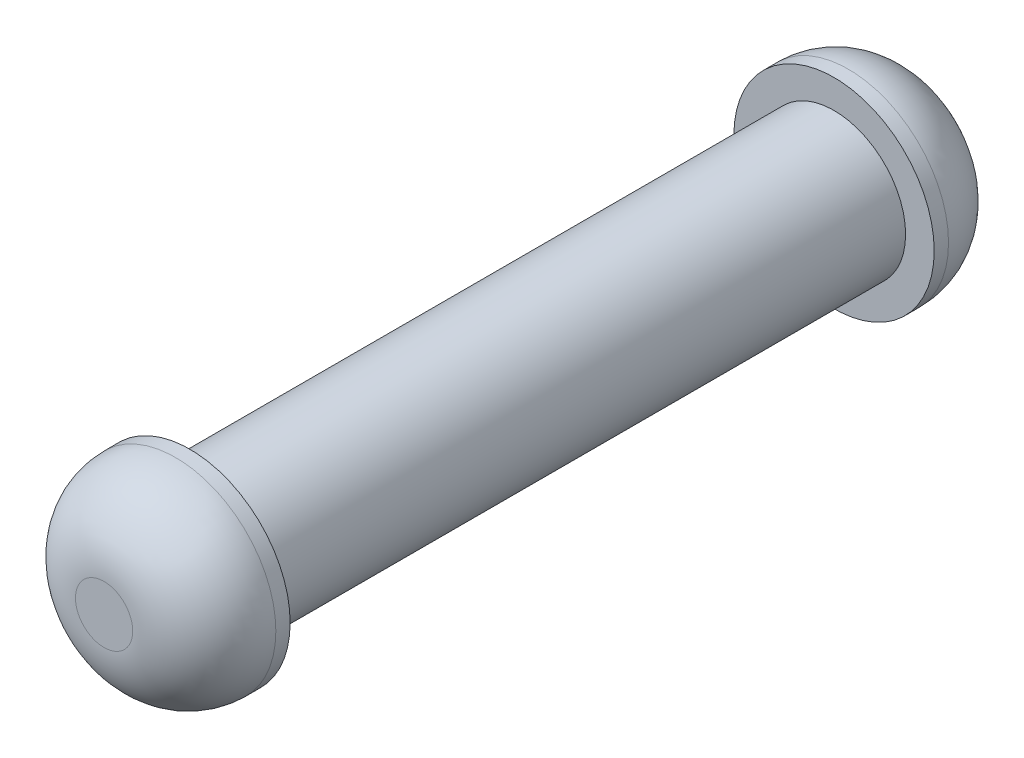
ISO-10303-21;
HEADER;
FILE_DESCRIPTION(('STEP AP214'),'2;1');
FILE_NAME('part.step','',(''),(''),'','','');
FILE_SCHEMA(('AUTOMOTIVE_DESIGN { 1 0 10303 214 1 1 1 1 }'));
ENDSEC;
DATA;
#1=APPLICATION_CONTEXT('core data for automotive mechanical design processes');
#2=APPLICATION_PROTOCOL_DEFINITION('international standard','automotive_design',2000,#1);
#3=PRODUCT_CONTEXT('',#1,'mechanical');
#4=PRODUCT('Part','Part','',(#3));
#5=PRODUCT_RELATED_PRODUCT_CATEGORY('part','',(#4));
#6=PRODUCT_DEFINITION_FORMATION('','',#4);
#7=PRODUCT_DEFINITION_CONTEXT('part definition',#1,'design');
#8=PRODUCT_DEFINITION('design','',#6,#7);
#9=PRODUCT_DEFINITION_SHAPE('','',#8);
#10=(LENGTH_UNIT() NAMED_UNIT(*) SI_UNIT(.MILLI.,.METRE.));
#11=(NAMED_UNIT(*) PLANE_ANGLE_UNIT() SI_UNIT($,.RADIAN.));
#12=(NAMED_UNIT(*) SI_UNIT($,.STERADIAN.) SOLID_ANGLE_UNIT());
#13=UNCERTAINTY_MEASURE_WITH_UNIT(LENGTH_MEASURE(1.E-05),#10,'distance_accuracy_value','');
#14=(GEOMETRIC_REPRESENTATION_CONTEXT(3) GLOBAL_UNCERTAINTY_ASSIGNED_CONTEXT((#13)) GLOBAL_UNIT_ASSIGNED_CONTEXT((#10,
#11,#12)) REPRESENTATION_CONTEXT('',''));
#15=CARTESIAN_POINT('',(0.,0.,0.));
#16=DIRECTION('',(0.,0.,1.));
#17=DIRECTION('',(1.,0.,0.));
#18=AXIS2_PLACEMENT_3D('',#15,#16,#17);
#19=CARTESIAN_POINT('',(-85.,45.0000000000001,136.5));
#20=DIRECTION('',(0.,0.,1.));
#21=DIRECTION('',(1.,0.,0.));
#22=AXIS2_PLACEMENT_3D('',#19,#20,#21);
#23=CYLINDRICAL_SURFACE('',#22,2.50000000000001);
#24=CARTESIAN_POINT('',(-85.,45.0000000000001,136.5));
#25=DIRECTION('',(0.,0.,1.));
#26=DIRECTION('',(1.,0.,0.));
#27=AXIS2_PLACEMENT_3D('',#24,#25,#26);
#28=CIRCLE('',#27,2.50000000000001);
#29=CARTESIAN_POINT('',(-82.5,45.0000000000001,136.5));
#30=VERTEX_POINT('',#29);
#31=EDGE_CURVE('E53',#30,#30,#28,.T.);
#32=ORIENTED_EDGE('',*,*,#31,.T.);
#33=EDGE_LOOP('',(#32));
#34=FACE_BOUND('',#33,.T.);
#35=CARTESIAN_POINT('',(-85.,45.0000000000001,159.));
#36=DIRECTION('',(0.,0.,1.));
#37=DIRECTION('',(1.,0.,0.));
#38=AXIS2_PLACEMENT_3D('',#35,#36,#37);
#39=CIRCLE('',#38,2.50000000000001);
#40=CARTESIAN_POINT('',(-82.5,45.0000000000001,159.));
#41=VERTEX_POINT('',#40);
#42=EDGE_CURVE('E50',#41,#41,#39,.T.);
#43=ORIENTED_EDGE('',*,*,#42,.F.);
#44=EDGE_LOOP('',(#43));
#45=FACE_BOUND('',#44,.T.);
#46=ADVANCED_FACE('F30',(#34,#45),#23,.T.);
#47=CARTESIAN_POINT('',(-85.,45.0000000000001,133.5));
#48=DIRECTION('',(0.,0.,1.));
#49=DIRECTION('',(1.,0.,0.));
#50=AXIS2_PLACEMENT_3D('',#47,#48,#49);
#51=CYLINDRICAL_SURFACE('',#50,3.50000000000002);
#52=CARTESIAN_POINT('',(-85.,45.0000000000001,136.));
#53=DIRECTION('',(0.,0.,-1.));
#54=DIRECTION('',(-1.,0.,0.));
#55=AXIS2_PLACEMENT_3D('',#52,#53,#54);
#56=CIRCLE('',#55,3.50000000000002);
#57=CARTESIAN_POINT('',(-88.5,45.0000000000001,136.));
#58=VERTEX_POINT('',#57);
#59=EDGE_CURVE('E41',#58,#58,#56,.F.);
#60=ORIENTED_EDGE('',*,*,#59,.T.);
#61=EDGE_LOOP('',(#60));
#62=FACE_BOUND('',#61,.T.);
#63=CARTESIAN_POINT('',(-85.,45.0000000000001,136.5));
#64=DIRECTION('',(0.,0.,-1.));
#65=DIRECTION('',(-1.,0.,0.));
#66=AXIS2_PLACEMENT_3D('',#63,#64,#65);
#67=CIRCLE('',#66,3.50000000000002);
#68=CARTESIAN_POINT('',(-88.5,45.0000000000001,136.5));
#69=VERTEX_POINT('',#68);
#70=EDGE_CURVE('E56',#69,#69,#67,.T.);
#71=ORIENTED_EDGE('',*,*,#70,.T.);
#72=EDGE_LOOP('',(#71));
#73=FACE_BOUND('',#72,.T.);
#74=ADVANCED_FACE('F78',(#62,#73),#51,.T.);
#75=CARTESIAN_POINT('',(-85.,45.0000000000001,133.5));
#76=DIRECTION('',(0.,0.,-1.));
#77=DIRECTION('',(-1.,0.,0.));
#78=AXIS2_PLACEMENT_3D('',#75,#76,#77);
#79=PLANE('',#78);
#80=CARTESIAN_POINT('',(-85.,45.0000000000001,133.5));
#81=DIRECTION('',(0.,0.,-1.));
#82=DIRECTION('',(-1.,0.,0.));
#83=AXIS2_PLACEMENT_3D('',#80,#81,#82);
#84=CIRCLE('',#83,1.00000000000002);
#85=CARTESIAN_POINT('',(-86.,45.0000000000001,133.5));
#86=VERTEX_POINT('',#85);
#87=EDGE_CURVE('E45',#86,#86,#84,.T.);
#88=ORIENTED_EDGE('',*,*,#87,.T.);
#89=EDGE_LOOP('',(#88));
#90=FACE_BOUND('',#89,.T.);
#91=ADVANCED_FACE('F84',(#90),#79,.T.);
#92=CARTESIAN_POINT('',(-85.,45.0000000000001,136.5));
#93=DIRECTION('',(0.,0.,-1.));
#94=DIRECTION('',(-1.,0.,0.));
#95=AXIS2_PLACEMENT_3D('',#92,#93,#94);
#96=PLANE('',#95);
#97=ORIENTED_EDGE('',*,*,#31,.F.);
#98=EDGE_LOOP('',(#97));
#99=FACE_BOUND('',#98,.T.);
#100=ORIENTED_EDGE('',*,*,#70,.F.);
#101=EDGE_LOOP('',(#100));
#102=FACE_BOUND('',#101,.T.);
#103=ADVANCED_FACE('F91',(#99,#102),#96,.F.);
#104=CARTESIAN_POINT('',(-85.,45.0000000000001,136.));
#105=DIRECTION('',(0.,0.,-1.));
#106=DIRECTION('',(-1.,0.,0.));
#107=AXIS2_PLACEMENT_3D('',#104,#105,#106);
#108=DEGENERATE_TOROIDAL_SURFACE('',#107,1.00000000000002,2.5,.T.);
#109=ORIENTED_EDGE('',*,*,#59,.F.);
#110=EDGE_LOOP('',(#109));
#111=FACE_BOUND('',#110,.T.);
#112=ORIENTED_EDGE('',*,*,#87,.F.);
#113=EDGE_LOOP('',(#112));
#114=FACE_BOUND('',#113,.T.);
#115=ADVANCED_FACE('F89',(#111,#114),#108,.T.);
#116=CARTESIAN_POINT('',(-85.,45.0000000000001,162.));
#117=DIRECTION('',(0.,0.,-1.));
#118=DIRECTION('',(-1.,0.,0.));
#119=AXIS2_PLACEMENT_3D('',#116,#117,#118);
#120=CYLINDRICAL_SURFACE('',#119,3.50000000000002);
#121=CARTESIAN_POINT('',(-85.,45.0000000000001,159.5));
#122=DIRECTION('',(0.,0.,1.));
#123=DIRECTION('',(1.,0.,0.));
#124=AXIS2_PLACEMENT_3D('',#121,#122,#123);
#125=CIRCLE('',#124,3.50000000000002);
#126=CARTESIAN_POINT('',(-81.5,45.0000000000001,159.5));
#127=VERTEX_POINT('',#126);
#128=EDGE_CURVE('E10',#127,#127,#125,.F.);
#129=ORIENTED_EDGE('',*,*,#128,.T.);
#130=EDGE_LOOP('',(#129));
#131=FACE_BOUND('',#130,.T.);
#132=CARTESIAN_POINT('',(-85.,45.0000000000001,159.));
#133=DIRECTION('',(0.,0.,1.));
#134=DIRECTION('',(1.,0.,0.));
#135=AXIS2_PLACEMENT_3D('',#132,#133,#134);
#136=CIRCLE('',#135,3.50000000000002);
#137=CARTESIAN_POINT('',(-81.5,45.0000000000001,159.));
#138=VERTEX_POINT('',#137);
#139=EDGE_CURVE('E59',#138,#138,#136,.T.);
#140=ORIENTED_EDGE('',*,*,#139,.T.);
#141=EDGE_LOOP('',(#140));
#142=FACE_BOUND('',#141,.T.);
#143=ADVANCED_FACE('F63',(#131,#142),#120,.T.);
#144=CARTESIAN_POINT('',(-85.,45.0000000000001,162.));
#145=DIRECTION('',(0.,0.,1.));
#146=DIRECTION('',(1.,0.,0.));
#147=AXIS2_PLACEMENT_3D('',#144,#145,#146);
#148=PLANE('',#147);
#149=CARTESIAN_POINT('',(-85.,45.0000000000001,162.));
#150=DIRECTION('',(0.,0.,1.));
#151=DIRECTION('',(1.,0.,0.));
#152=AXIS2_PLACEMENT_3D('',#149,#150,#151);
#153=CIRCLE('',#152,1.00000000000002);
#154=CARTESIAN_POINT('',(-84.,45.0000000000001,162.));
#155=VERTEX_POINT('',#154);
#156=EDGE_CURVE('E37',#155,#155,#153,.T.);
#157=ORIENTED_EDGE('',*,*,#156,.T.);
#158=EDGE_LOOP('',(#157));
#159=FACE_BOUND('',#158,.T.);
#160=ADVANCED_FACE('F67',(#159),#148,.T.);
#161=CARTESIAN_POINT('',(-85.,45.0000000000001,159.));
#162=DIRECTION('',(0.,0.,1.));
#163=DIRECTION('',(1.,0.,0.));
#164=AXIS2_PLACEMENT_3D('',#161,#162,#163);
#165=PLANE('',#164);
#166=ORIENTED_EDGE('',*,*,#42,.T.);
#167=EDGE_LOOP('',(#166));
#168=FACE_BOUND('',#167,.T.);
#169=ORIENTED_EDGE('',*,*,#139,.F.);
#170=EDGE_LOOP('',(#169));
#171=FACE_BOUND('',#170,.T.);
#172=ADVANCED_FACE('F65',(#168,#171),#165,.F.);
#173=CARTESIAN_POINT('',(-85.,45.0000000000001,159.5));
#174=DIRECTION('',(0.,0.,1.));
#175=DIRECTION('',(1.,0.,0.));
#176=AXIS2_PLACEMENT_3D('',#173,#174,#175);
#177=DEGENERATE_TOROIDAL_SURFACE('',#176,1.00000000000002,2.5,.T.);
#178=ORIENTED_EDGE('',*,*,#128,.F.);
#179=EDGE_LOOP('',(#178));
#180=FACE_BOUND('',#179,.T.);
#181=ORIENTED_EDGE('',*,*,#156,.F.);
#182=EDGE_LOOP('',(#181));
#183=FACE_BOUND('',#182,.T.);
#184=ADVANCED_FACE('F32',(#180,#183),#177,.T.);
#185=CLOSED_SHELL('',(#46,#74,#91,#103,#115,#143,#160,#172,#184));
#186=MANIFOLD_SOLID_BREP('B2',#185);
#187=ADVANCED_BREP_SHAPE_REPRESENTATION('',(#18,#186),#14);
#188=SHAPE_DEFINITION_REPRESENTATION(#9,#187);
ENDSEC;
END-ISO-10303-21;
